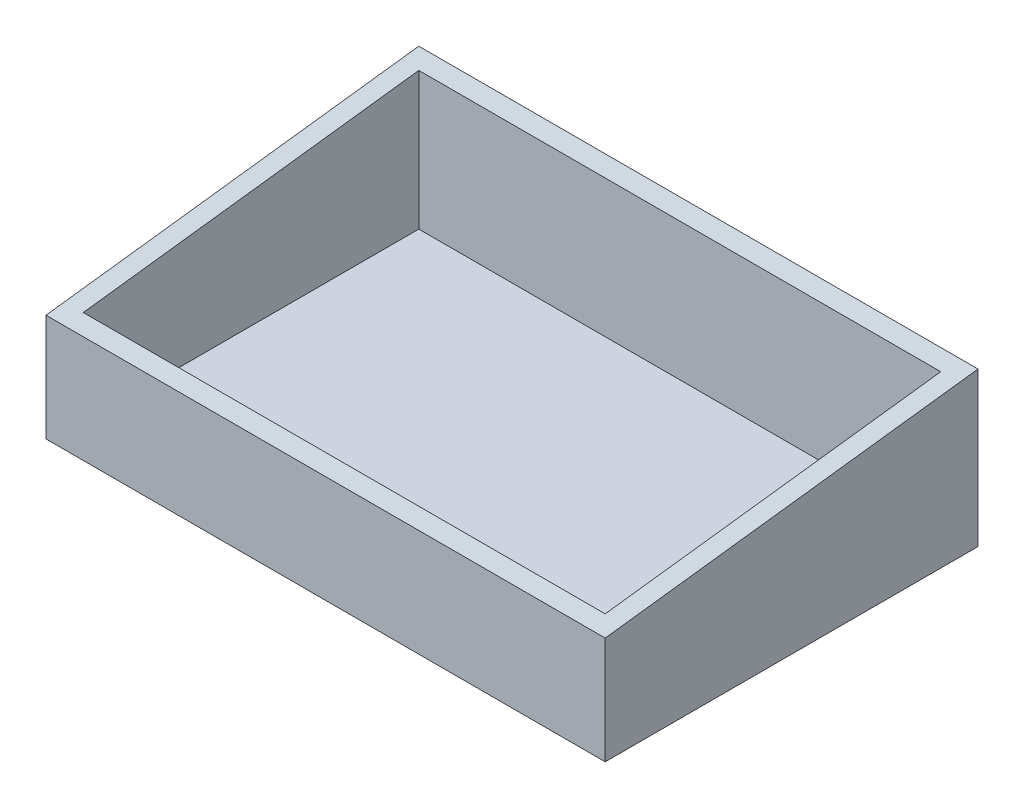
from build123d import *

# Parameters (mm, degrees)
ESQUISSE1_W           = 400
ESQUISSE1_H           = 165
EXTRUSION1_DEPTH      = 600
EXTRUSION3_DEPTH      = 740.746578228
EXTRUSION3_DEPTH_BACK = 740.746578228
ESQUISSE2_W           = 560
ESQUISSE2_H           = 360
EXTRUSION4_DEPTH      = 150


with BuildPart() as part:
    # Esquisse1 → Extrusion1 (new body)
    with BuildSketch(Plane(origin=(0, 0, 0), x_dir=(0, 0, -1), z_dir=(1, 0, 0))):
        with Locations((-200, 82.5)):
            Rectangle(ESQUISSE1_W, ESQUISSE1_H)
    extrude(amount=-EXTRUSION1_DEPTH)

    # Esquisse3 → Extrusion3 (cut, two sides: drawn at the far end of the back side and taken through both)
    with BuildSketch(Plane.ZY.offset(600).offset(-EXTRUSION3_DEPTH_BACK)):
        Polygon((-868.630215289, 273.578776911), (0, 165), (400, 115), (1268.630215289, 6.421223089), (1485.787769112, 1743.681653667), (-651.472661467, 2010.83920749), align=None)
    extrude(amount=EXTRUSION3_DEPTH + EXTRUSION3_DEPTH_BACK, mode=Mode.SUBTRACT)

    # Esquisse2 → Extrusion4 (cut)
    with BuildSketch(Plane(origin=(0, 165, 0), x_dir=(1, 0, 0), z_dir=(0, 1, 0))):
        with Locations((-300, -200)):
            Rectangle(ESQUISSE2_W, ESQUISSE2_H)
    extrude(amount=-EXTRUSION4_DEPTH, mode=Mode.SUBTRACT)


solid = part.part
